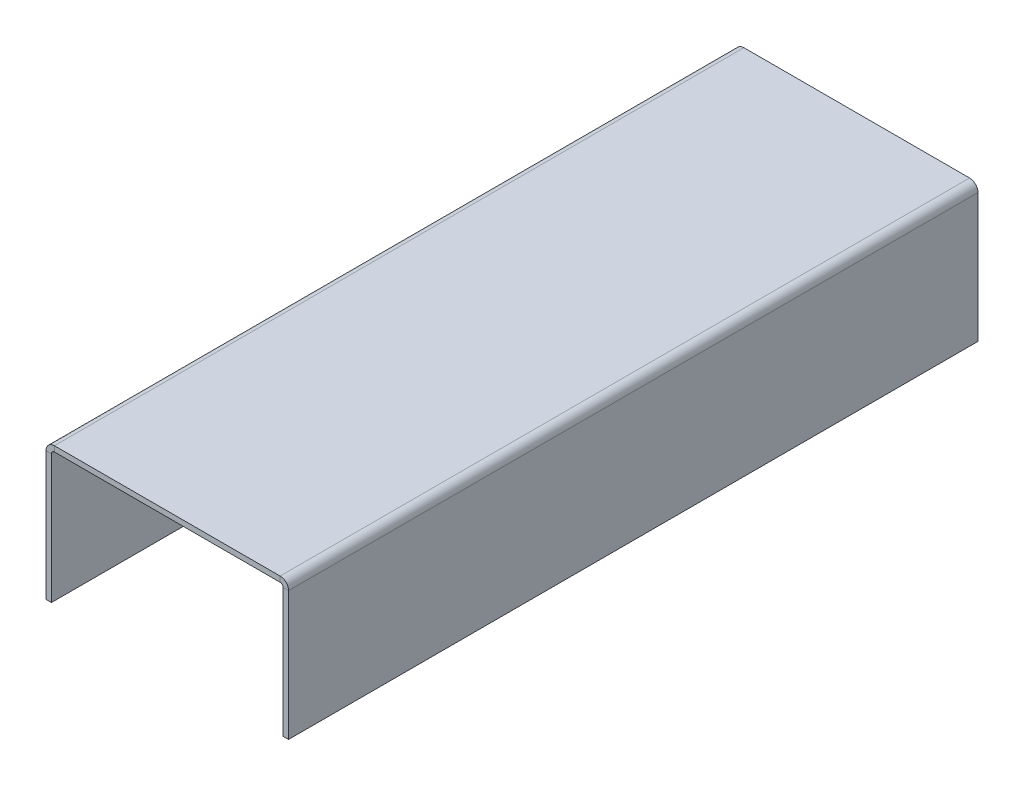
ISO-10303-21;
HEADER;
FILE_DESCRIPTION(('STEP AP214'),'2;1');
FILE_NAME('part.step','',(''),(''),'','','');
FILE_SCHEMA(('AUTOMOTIVE_DESIGN { 1 0 10303 214 1 1 1 1 }'));
ENDSEC;
DATA;
#1=APPLICATION_CONTEXT('core data for automotive mechanical design processes');
#2=APPLICATION_PROTOCOL_DEFINITION('international standard','automotive_design',2000,#1);
#3=PRODUCT_CONTEXT('',#1,'mechanical');
#4=PRODUCT('Part','Part','',(#3));
#5=PRODUCT_RELATED_PRODUCT_CATEGORY('part','',(#4));
#6=PRODUCT_DEFINITION_FORMATION('','',#4);
#7=PRODUCT_DEFINITION_CONTEXT('part definition',#1,'design');
#8=PRODUCT_DEFINITION('design','',#6,#7);
#9=PRODUCT_DEFINITION_SHAPE('','',#8);
#10=(LENGTH_UNIT() NAMED_UNIT(*) SI_UNIT(.MILLI.,.METRE.));
#11=(NAMED_UNIT(*) PLANE_ANGLE_UNIT() SI_UNIT($,.RADIAN.));
#12=(NAMED_UNIT(*) SI_UNIT($,.STERADIAN.) SOLID_ANGLE_UNIT());
#13=UNCERTAINTY_MEASURE_WITH_UNIT(LENGTH_MEASURE(1.E-05),#10,'distance_accuracy_value','');
#14=(GEOMETRIC_REPRESENTATION_CONTEXT(3) GLOBAL_UNCERTAINTY_ASSIGNED_CONTEXT((#13)) GLOBAL_UNIT_ASSIGNED_CONTEXT((#10,
#11,#12)) REPRESENTATION_CONTEXT('',''));
#15=CARTESIAN_POINT('',(0.,0.,0.));
#16=DIRECTION('',(0.,0.,1.));
#17=DIRECTION('',(1.,0.,0.));
#18=AXIS2_PLACEMENT_3D('',#15,#16,#17);
#19=CARTESIAN_POINT('',(1.778,28.9868499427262,145.542));
#20=DIRECTION('',(0.,0.,1.));
#21=DIRECTION('',(1.,0.,0.));
#22=AXIS2_PLACEMENT_3D('',#19,#20,#21);
#23=PLANE('',#22);
#24=DIRECTION('',(0.,-1.,0.));
#25=VECTOR('',#24,1.);
#26=CARTESIAN_POINT('',(1.778,28.9868499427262,145.542));
#27=LINE('',#26,#25);
#28=CARTESIAN_POINT('',(1.778,28.9868499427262,145.542));
#29=VERTEX_POINT('',#28);
#30=CARTESIAN_POINT('',(1.778,27.8438499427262,145.542));
#31=VERTEX_POINT('',#30);
#32=EDGE_CURVE('E11',#29,#31,#27,.T.);
#33=ORIENTED_EDGE('',*,*,#32,.F.);
#34=CARTESIAN_POINT('',(1.778,27.2088499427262,145.542));
#35=DIRECTION('',(0.,0.,1.));
#36=DIRECTION('',(1.,0.,0.));
#37=AXIS2_PLACEMENT_3D('',#34,#35,#36);
#38=CIRCLE('',#37,1.778);
#39=CARTESIAN_POINT('',(0.,27.2088499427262,145.542));
#40=VERTEX_POINT('',#39);
#41=EDGE_CURVE('E249',#40,#29,#38,.F.);
#42=ORIENTED_EDGE('',*,*,#41,.F.);
#43=DIRECTION('',(-1.,0.,0.));
#44=VECTOR('',#43,1.);
#45=CARTESIAN_POINT('',(1.143,27.2088499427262,145.542));
#46=LINE('',#45,#44);
#47=CARTESIAN_POINT('',(1.143,27.2088499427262,145.542));
#48=VERTEX_POINT('',#47);
#49=EDGE_CURVE('E47',#48,#40,#46,.T.);
#50=ORIENTED_EDGE('',*,*,#49,.F.);
#51=CARTESIAN_POINT('',(1.778,27.2088499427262,145.542));
#52=DIRECTION('',(0.,0.,1.));
#53=DIRECTION('',(1.,0.,0.));
#54=AXIS2_PLACEMENT_3D('',#51,#52,#53);
#55=CIRCLE('',#54,0.635);
#56=EDGE_CURVE('E148',#48,#31,#55,.F.);
#57=ORIENTED_EDGE('',*,*,#56,.T.);
#58=EDGE_LOOP('',(#33,#42,#50,#57));
#59=FACE_BOUND('',#58,.T.);
#60=ADVANCED_FACE('F39',(#59),#23,.T.);
#61=CARTESIAN_POINT('',(1.143,27.2088499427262,145.542));
#62=DIRECTION('',(0.,0.,1.));
#63=DIRECTION('',(1.,0.,0.));
#64=AXIS2_PLACEMENT_3D('',#61,#62,#63);
#65=PLANE('',#64);
#66=DIRECTION('',(1.,0.,0.));
#67=VECTOR('',#66,1.);
#68=CARTESIAN_POINT('',(0.,28.9868499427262,145.542));
#69=LINE('',#68,#67);
#70=CARTESIAN_POINT('',(49.4215990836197,28.9868499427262,145.542));
#71=VERTEX_POINT('',#70);
#72=EDGE_CURVE('E142',#29,#71,#69,.T.);
#73=ORIENTED_EDGE('',*,*,#72,.F.);
#74=ORIENTED_EDGE('',*,*,#32,.T.);
#75=DIRECTION('',(1.,0.,0.));
#76=VECTOR('',#75,1.);
#77=CARTESIAN_POINT('',(0.,27.8438499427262,145.542));
#78=LINE('',#77,#76);
#79=CARTESIAN_POINT('',(49.4215990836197,27.8438499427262,145.542));
#80=VERTEX_POINT('',#79);
#81=EDGE_CURVE('E139',#31,#80,#78,.T.);
#82=ORIENTED_EDGE('',*,*,#81,.T.);
#83=DIRECTION('',(0.,1.,0.));
#84=VECTOR('',#83,1.);
#85=CARTESIAN_POINT('',(49.4215990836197,27.8438499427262,145.542));
#86=LINE('',#85,#84);
#87=EDGE_CURVE('E230',#80,#71,#86,.T.);
#88=ORIENTED_EDGE('',*,*,#87,.T.);
#89=EDGE_LOOP('',(#73,#74,#82,#88));
#90=FACE_BOUND('',#89,.T.);
#91=ADVANCED_FACE('F137',(#90),#65,.T.);
#92=CARTESIAN_POINT('',(0.,27.2088499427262,0.));
#93=DIRECTION('',(0.,0.,-1.));
#94=DIRECTION('',(-1.,0.,0.));
#95=AXIS2_PLACEMENT_3D('',#92,#93,#94);
#96=PLANE('',#95);
#97=DIRECTION('',(1.,0.,0.));
#98=VECTOR('',#97,1.);
#99=CARTESIAN_POINT('',(0.,27.2088499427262,0.));
#100=LINE('',#99,#98);
#101=CARTESIAN_POINT('',(0.,27.2088499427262,0.));
#102=VERTEX_POINT('',#101);
#103=CARTESIAN_POINT('',(1.143,27.2088499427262,0.));
#104=VERTEX_POINT('',#103);
#105=EDGE_CURVE('E235',#102,#104,#100,.T.);
#106=ORIENTED_EDGE('',*,*,#105,.F.);
#107=CARTESIAN_POINT('',(1.778,27.2088499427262,0.));
#108=DIRECTION('',(0.,0.,1.));
#109=DIRECTION('',(1.,0.,0.));
#110=AXIS2_PLACEMENT_3D('',#107,#108,#109);
#111=CIRCLE('',#110,1.778);
#112=CARTESIAN_POINT('',(1.778,28.9868499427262,0.));
#113=VERTEX_POINT('',#112);
#114=EDGE_CURVE('E187',#102,#113,#111,.F.);
#115=ORIENTED_EDGE('',*,*,#114,.T.);
#116=DIRECTION('',(0.,1.,0.));
#117=VECTOR('',#116,1.);
#118=CARTESIAN_POINT('',(1.778,27.8438499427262,0.));
#119=LINE('',#118,#117);
#120=CARTESIAN_POINT('',(1.778,27.8438499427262,0.));
#121=VERTEX_POINT('',#120);
#122=EDGE_CURVE('E233',#121,#113,#119,.T.);
#123=ORIENTED_EDGE('',*,*,#122,.F.);
#124=CARTESIAN_POINT('',(1.778,27.2088499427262,0.));
#125=DIRECTION('',(0.,0.,1.));
#126=DIRECTION('',(1.,0.,0.));
#127=AXIS2_PLACEMENT_3D('',#124,#125,#126);
#128=CIRCLE('',#127,0.635);
#129=EDGE_CURVE('E160',#104,#121,#128,.F.);
#130=ORIENTED_EDGE('',*,*,#129,.F.);
#131=EDGE_LOOP('',(#106,#115,#123,#130));
#132=FACE_BOUND('',#131,.T.);
#133=ADVANCED_FACE('F287',(#132),#96,.T.);
#134=CARTESIAN_POINT('',(1.778,27.8438499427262,0.));
#135=DIRECTION('',(0.,0.,-1.));
#136=DIRECTION('',(-1.,0.,0.));
#137=AXIS2_PLACEMENT_3D('',#134,#135,#136);
#138=PLANE('',#137);
#139=DIRECTION('',(0.,1.,0.));
#140=VECTOR('',#139,1.);
#141=CARTESIAN_POINT('',(0.,0.,0.));
#142=LINE('',#141,#140);
#143=CARTESIAN_POINT('',(0.,0.,0.));
#144=VERTEX_POINT('',#143);
#145=EDGE_CURVE('E190',#144,#102,#142,.T.);
#146=ORIENTED_EDGE('',*,*,#145,.T.);
#147=ORIENTED_EDGE('',*,*,#105,.T.);
#148=DIRECTION('',(0.,1.,0.));
#149=VECTOR('',#148,1.);
#150=CARTESIAN_POINT('',(1.143,0.,0.));
#151=LINE('',#150,#149);
#152=CARTESIAN_POINT('',(1.143,0.,0.));
#153=VERTEX_POINT('',#152);
#154=EDGE_CURVE('E196',#153,#104,#151,.T.);
#155=ORIENTED_EDGE('',*,*,#154,.F.);
#156=DIRECTION('',(-1.,0.,0.));
#157=VECTOR('',#156,1.);
#158=CARTESIAN_POINT('',(1.143,0.,0.));
#159=LINE('',#158,#157);
#160=EDGE_CURVE('E193',#153,#144,#159,.T.);
#161=ORIENTED_EDGE('',*,*,#160,.T.);
#162=EDGE_LOOP('',(#146,#147,#155,#161));
#163=FACE_BOUND('',#162,.T.);
#164=ADVANCED_FACE('F290',(#163),#138,.T.);
#165=CARTESIAN_POINT('',(51.1995990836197,27.2088499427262,145.542));
#166=DIRECTION('',(0.,0.,1.));
#167=DIRECTION('',(1.,0.,0.));
#168=AXIS2_PLACEMENT_3D('',#165,#166,#167);
#169=PLANE('',#168);
#170=DIRECTION('',(-1.,0.,0.));
#171=VECTOR('',#170,1.);
#172=CARTESIAN_POINT('',(51.1995990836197,27.2088499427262,145.542));
#173=LINE('',#172,#171);
#174=CARTESIAN_POINT('',(51.1995990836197,27.2088499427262,145.542));
#175=VERTEX_POINT('',#174);
#176=CARTESIAN_POINT('',(50.0565990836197,27.2088499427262,145.542));
#177=VERTEX_POINT('',#176);
#178=EDGE_CURVE('E55',#175,#177,#173,.T.);
#179=ORIENTED_EDGE('',*,*,#178,.F.);
#180=CARTESIAN_POINT('',(49.4215990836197,27.2088499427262,145.542));
#181=DIRECTION('',(0.,0.,1.));
#182=DIRECTION('',(1.,0.,0.));
#183=AXIS2_PLACEMENT_3D('',#180,#181,#182);
#184=CIRCLE('',#183,1.778);
#185=EDGE_CURVE('E259',#71,#175,#184,.F.);
#186=ORIENTED_EDGE('',*,*,#185,.F.);
#187=ORIENTED_EDGE('',*,*,#87,.F.);
#188=CARTESIAN_POINT('',(49.4215990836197,27.2088499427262,145.542));
#189=DIRECTION('',(0.,0.,1.));
#190=DIRECTION('',(1.,0.,0.));
#191=AXIS2_PLACEMENT_3D('',#188,#189,#190);
#192=CIRCLE('',#191,0.635);
#193=EDGE_CURVE('E168',#80,#177,#192,.F.);
#194=ORIENTED_EDGE('',*,*,#193,.T.);
#195=EDGE_LOOP('',(#179,#186,#187,#194));
#196=FACE_BOUND('',#195,.T.);
#197=ADVANCED_FACE('F282',(#196),#169,.T.);
#198=CARTESIAN_POINT('',(49.4215990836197,27.8438499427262,145.542));
#199=DIRECTION('',(0.,0.,1.));
#200=DIRECTION('',(1.,0.,0.));
#201=AXIS2_PLACEMENT_3D('',#198,#199,#200);
#202=PLANE('',#201);
#203=DIRECTION('',(0.,-1.,0.));
#204=VECTOR('',#203,1.);
#205=CARTESIAN_POINT('',(51.1995990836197,28.9868499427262,145.542));
#206=LINE('',#205,#204);
#207=CARTESIAN_POINT('',(51.1995990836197,0.,145.542));
#208=VERTEX_POINT('',#207);
#209=EDGE_CURVE('E262',#175,#208,#206,.T.);
#210=ORIENTED_EDGE('',*,*,#209,.F.);
#211=ORIENTED_EDGE('',*,*,#178,.T.);
#212=DIRECTION('',(0.,1.,0.));
#213=VECTOR('',#212,1.);
#214=CARTESIAN_POINT('',(50.0565990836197,28.9868499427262,145.542));
#215=LINE('',#214,#213);
#216=CARTESIAN_POINT('',(50.0565990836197,0.,145.542));
#217=VERTEX_POINT('',#216);
#218=EDGE_CURVE('E109',#177,#217,#215,.F.);
#219=ORIENTED_EDGE('',*,*,#218,.T.);
#220=DIRECTION('',(-1.,0.,0.));
#221=VECTOR('',#220,1.);
#222=CARTESIAN_POINT('',(51.1995990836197,0.,145.542));
#223=LINE('',#222,#221);
#224=EDGE_CURVE('E265',#208,#217,#223,.T.);
#225=ORIENTED_EDGE('',*,*,#224,.F.);
#226=EDGE_LOOP('',(#210,#211,#219,#225));
#227=FACE_BOUND('',#226,.T.);
#228=ADVANCED_FACE('F271',(#227),#202,.T.);
#229=CARTESIAN_POINT('',(49.4215990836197,28.9868499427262,0.));
#230=DIRECTION('',(0.,0.,-1.));
#231=DIRECTION('',(-1.,0.,0.));
#232=AXIS2_PLACEMENT_3D('',#229,#230,#231);
#233=PLANE('',#232);
#234=DIRECTION('',(0.,-1.,0.));
#235=VECTOR('',#234,1.);
#236=CARTESIAN_POINT('',(49.4215990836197,28.9868499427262,0.));
#237=LINE('',#236,#235);
#238=CARTESIAN_POINT('',(49.4215990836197,28.9868499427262,0.));
#239=VERTEX_POINT('',#238);
#240=CARTESIAN_POINT('',(49.4215990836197,27.8438499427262,0.));
#241=VERTEX_POINT('',#240);
#242=EDGE_CURVE('E96',#239,#241,#237,.T.);
#243=ORIENTED_EDGE('',*,*,#242,.F.);
#244=CARTESIAN_POINT('',(49.4215990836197,27.2088499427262,0.));
#245=DIRECTION('',(0.,0.,1.));
#246=DIRECTION('',(1.,0.,0.));
#247=AXIS2_PLACEMENT_3D('',#244,#245,#246);
#248=CIRCLE('',#247,1.778);
#249=CARTESIAN_POINT('',(51.1995990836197,27.2088499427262,0.));
#250=VERTEX_POINT('',#249);
#251=EDGE_CURVE('E183',#239,#250,#248,.F.);
#252=ORIENTED_EDGE('',*,*,#251,.T.);
#253=DIRECTION('',(1.,0.,0.));
#254=VECTOR('',#253,1.);
#255=CARTESIAN_POINT('',(50.0565990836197,27.2088499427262,0.));
#256=LINE('',#255,#254);
#257=CARTESIAN_POINT('',(50.0565990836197,27.2088499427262,0.));
#258=VERTEX_POINT('',#257);
#259=EDGE_CURVE('E103',#258,#250,#256,.T.);
#260=ORIENTED_EDGE('',*,*,#259,.F.);
#261=CARTESIAN_POINT('',(49.4215990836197,27.2088499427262,0.));
#262=DIRECTION('',(0.,0.,1.));
#263=DIRECTION('',(1.,0.,0.));
#264=AXIS2_PLACEMENT_3D('',#261,#262,#263);
#265=CIRCLE('',#264,0.635);
#266=EDGE_CURVE('E202',#241,#258,#265,.F.);
#267=ORIENTED_EDGE('',*,*,#266,.F.);
#268=EDGE_LOOP('',(#243,#252,#260,#267));
#269=FACE_BOUND('',#268,.T.);
#270=ADVANCED_FACE('F319',(#269),#233,.T.);
#271=CARTESIAN_POINT('',(50.0565990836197,27.2088499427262,0.));
#272=DIRECTION('',(0.,0.,-1.));
#273=DIRECTION('',(-1.,0.,0.));
#274=AXIS2_PLACEMENT_3D('',#271,#272,#273);
#275=PLANE('',#274);
#276=DIRECTION('',(1.,0.,0.));
#277=VECTOR('',#276,1.);
#278=CARTESIAN_POINT('',(0.,28.9868499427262,0.));
#279=LINE('',#278,#277);
#280=EDGE_CURVE('E185',#113,#239,#279,.T.);
#281=ORIENTED_EDGE('',*,*,#280,.T.);
#282=ORIENTED_EDGE('',*,*,#242,.T.);
#283=DIRECTION('',(1.,0.,0.));
#284=VECTOR('',#283,1.);
#285=CARTESIAN_POINT('',(0.,27.8438499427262,0.));
#286=LINE('',#285,#284);
#287=EDGE_CURVE('E200',#121,#241,#286,.T.);
#288=ORIENTED_EDGE('',*,*,#287,.F.);
#289=ORIENTED_EDGE('',*,*,#122,.T.);
#290=EDGE_LOOP('',(#281,#282,#288,#289));
#291=FACE_BOUND('',#290,.T.);
#292=ADVANCED_FACE('F322',(#291),#275,.T.);
#293=CARTESIAN_POINT('',(50.0565990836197,28.9868499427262,145.542));
#294=DIRECTION('',(1.,0.,0.));
#295=DIRECTION('',(0.,0.,-1.));
#296=AXIS2_PLACEMENT_3D('',#293,#294,#295);
#297=PLANE('',#296);
#298=DIRECTION('',(0.,1.,0.));
#299=VECTOR('',#298,1.);
#300=CARTESIAN_POINT('',(50.0565990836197,28.9868499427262,0.));
#301=LINE('',#300,#299);
#302=CARTESIAN_POINT('',(50.0565990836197,0.,0.));
#303=VERTEX_POINT('',#302);
#304=EDGE_CURVE('E174',#258,#303,#301,.F.);
#305=ORIENTED_EDGE('',*,*,#304,.T.);
#306=DIRECTION('',(0.,0.,-1.));
#307=VECTOR('',#306,1.);
#308=CARTESIAN_POINT('',(50.0565990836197,0.,145.542));
#309=LINE('',#308,#307);
#310=EDGE_CURVE('E226',#217,#303,#309,.T.);
#311=ORIENTED_EDGE('',*,*,#310,.F.);
#312=ORIENTED_EDGE('',*,*,#218,.F.);
#313=DIRECTION('',(0.,0.,-1.));
#314=VECTOR('',#313,1.);
#315=CARTESIAN_POINT('',(50.0565990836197,27.2088499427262,145.542));
#316=LINE('',#315,#314);
#317=EDGE_CURVE('E170',#177,#258,#316,.T.);
#318=ORIENTED_EDGE('',*,*,#317,.T.);
#319=EDGE_LOOP('',(#305,#311,#312,#318));
#320=FACE_BOUND('',#319,.T.);
#321=ADVANCED_FACE('F325',(#320),#297,.F.);
#322=CARTESIAN_POINT('',(51.1995990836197,0.,145.542));
#323=DIRECTION('',(0.,-1.,0.));
#324=DIRECTION('',(0.,0.,-1.));
#325=AXIS2_PLACEMENT_3D('',#322,#323,#324);
#326=PLANE('',#325);
#327=DIRECTION('',(-1.,0.,0.));
#328=VECTOR('',#327,1.);
#329=CARTESIAN_POINT('',(51.1995990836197,0.,0.));
#330=LINE('',#329,#328);
#331=CARTESIAN_POINT('',(51.1995990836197,0.,0.));
#332=VERTEX_POINT('',#331);
#333=EDGE_CURVE('E177',#332,#303,#330,.T.);
#334=ORIENTED_EDGE('',*,*,#333,.F.);
#335=DIRECTION('',(0.,0.,-1.));
#336=VECTOR('',#335,1.);
#337=CARTESIAN_POINT('',(51.1995990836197,0.,145.542));
#338=LINE('',#337,#336);
#339=EDGE_CURVE('E224',#208,#332,#338,.T.);
#340=ORIENTED_EDGE('',*,*,#339,.F.);
#341=ORIENTED_EDGE('',*,*,#224,.T.);
#342=ORIENTED_EDGE('',*,*,#310,.T.);
#343=EDGE_LOOP('',(#334,#340,#341,#342));
#344=FACE_BOUND('',#343,.T.);
#345=ADVANCED_FACE('F270',(#344),#326,.T.);
#346=CARTESIAN_POINT('',(51.1995990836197,28.9868499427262,145.542));
#347=DIRECTION('',(1.,0.,0.));
#348=DIRECTION('',(0.,0.,-1.));
#349=AXIS2_PLACEMENT_3D('',#346,#347,#348);
#350=PLANE('',#349);
#351=DIRECTION('',(0.,-1.,0.));
#352=VECTOR('',#351,1.);
#353=CARTESIAN_POINT('',(51.1995990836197,28.9868499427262,0.));
#354=LINE('',#353,#352);
#355=EDGE_CURVE('E180',#250,#332,#354,.T.);
#356=ORIENTED_EDGE('',*,*,#355,.F.);
#357=DIRECTION('',(0.,0.,-1.));
#358=VECTOR('',#357,1.);
#359=CARTESIAN_POINT('',(51.1995990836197,27.2088499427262,145.542));
#360=LINE('',#359,#358);
#361=EDGE_CURVE('E221',#175,#250,#360,.T.);
#362=ORIENTED_EDGE('',*,*,#361,.F.);
#363=ORIENTED_EDGE('',*,*,#209,.T.);
#364=ORIENTED_EDGE('',*,*,#339,.T.);
#365=EDGE_LOOP('',(#356,#362,#363,#364));
#366=FACE_BOUND('',#365,.T.);
#367=ADVANCED_FACE('F275',(#366),#350,.T.);
#368=CARTESIAN_POINT('',(49.4215990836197,27.2088499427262,145.542));
#369=DIRECTION('',(0.,0.,-1.));
#370=DIRECTION('',(-1.,0.,0.));
#371=AXIS2_PLACEMENT_3D('',#368,#369,#370);
#372=CYLINDRICAL_SURFACE('',#371,1.778);
#373=ORIENTED_EDGE('',*,*,#251,.F.);
#374=DIRECTION('',(0.,0.,-1.));
#375=VECTOR('',#374,1.);
#376=CARTESIAN_POINT('',(49.4215990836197,28.9868499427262,145.542));
#377=LINE('',#376,#375);
#378=EDGE_CURVE('E218',#71,#239,#377,.T.);
#379=ORIENTED_EDGE('',*,*,#378,.F.);
#380=ORIENTED_EDGE('',*,*,#185,.T.);
#381=ORIENTED_EDGE('',*,*,#361,.T.);
#382=EDGE_LOOP('',(#373,#379,#380,#381));
#383=FACE_BOUND('',#382,.T.);
#384=ADVANCED_FACE('F278',(#383),#372,.T.);
#385=CARTESIAN_POINT('',(0.,28.9868499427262,145.542));
#386=DIRECTION('',(0.,1.,0.));
#387=DIRECTION('',(0.,0.,1.));
#388=AXIS2_PLACEMENT_3D('',#385,#386,#387);
#389=PLANE('',#388);
#390=ORIENTED_EDGE('',*,*,#280,.F.);
#391=DIRECTION('',(0.,0.,-1.));
#392=VECTOR('',#391,1.);
#393=CARTESIAN_POINT('',(1.778,28.9868499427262,145.542));
#394=LINE('',#393,#392);
#395=EDGE_CURVE('E215',#29,#113,#394,.T.);
#396=ORIENTED_EDGE('',*,*,#395,.F.);
#397=ORIENTED_EDGE('',*,*,#72,.T.);
#398=ORIENTED_EDGE('',*,*,#378,.T.);
#399=EDGE_LOOP('',(#390,#396,#397,#398));
#400=FACE_BOUND('',#399,.T.);
#401=ADVANCED_FACE('F285',(#400),#389,.T.);
#402=CARTESIAN_POINT('',(1.778,27.2088499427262,145.542));
#403=DIRECTION('',(0.,0.,-1.));
#404=DIRECTION('',(-1.,0.,0.));
#405=AXIS2_PLACEMENT_3D('',#402,#403,#404);
#406=CYLINDRICAL_SURFACE('',#405,1.778);
#407=ORIENTED_EDGE('',*,*,#114,.F.);
#408=DIRECTION('',(0.,0.,-1.));
#409=VECTOR('',#408,1.);
#410=CARTESIAN_POINT('',(0.,27.2088499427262,145.542));
#411=LINE('',#410,#409);
#412=EDGE_CURVE('E212',#40,#102,#411,.T.);
#413=ORIENTED_EDGE('',*,*,#412,.F.);
#414=ORIENTED_EDGE('',*,*,#41,.T.);
#415=ORIENTED_EDGE('',*,*,#395,.T.);
#416=EDGE_LOOP('',(#407,#413,#414,#415));
#417=FACE_BOUND('',#416,.T.);
#418=ADVANCED_FACE('F248',(#417),#406,.T.);
#419=CARTESIAN_POINT('',(0.,0.,145.542));
#420=DIRECTION('',(-1.,0.,0.));
#421=DIRECTION('',(0.,0.,1.));
#422=AXIS2_PLACEMENT_3D('',#419,#420,#421);
#423=PLANE('',#422);
#424=ORIENTED_EDGE('',*,*,#145,.F.);
#425=DIRECTION('',(0.,0.,-1.));
#426=VECTOR('',#425,1.);
#427=CARTESIAN_POINT('',(0.,0.,145.542));
#428=LINE('',#427,#426);
#429=CARTESIAN_POINT('',(0.,0.,145.542));
#430=VERTEX_POINT('',#429);
#431=EDGE_CURVE('E210',#430,#144,#428,.T.);
#432=ORIENTED_EDGE('',*,*,#431,.F.);
#433=DIRECTION('',(0.,1.,0.));
#434=VECTOR('',#433,1.);
#435=CARTESIAN_POINT('',(0.,0.,145.542));
#436=LINE('',#435,#434);
#437=EDGE_CURVE('E242',#430,#40,#436,.T.);
#438=ORIENTED_EDGE('',*,*,#437,.T.);
#439=ORIENTED_EDGE('',*,*,#412,.T.);
#440=EDGE_LOOP('',(#424,#432,#438,#439));
#441=FACE_BOUND('',#440,.T.);
#442=ADVANCED_FACE('F253',(#441),#423,.T.);
#443=CARTESIAN_POINT('',(1.143,0.,145.542));
#444=DIRECTION('',(0.,-1.,0.));
#445=DIRECTION('',(0.,0.,-1.));
#446=AXIS2_PLACEMENT_3D('',#443,#444,#445);
#447=PLANE('',#446);
#448=ORIENTED_EDGE('',*,*,#160,.F.);
#449=DIRECTION('',(0.,0.,-1.));
#450=VECTOR('',#449,1.);
#451=CARTESIAN_POINT('',(1.143,0.,145.542));
#452=LINE('',#451,#450);
#453=CARTESIAN_POINT('',(1.143,0.,145.542));
#454=VERTEX_POINT('',#453);
#455=EDGE_CURVE('E208',#454,#153,#452,.T.);
#456=ORIENTED_EDGE('',*,*,#455,.F.);
#457=DIRECTION('',(-1.,0.,0.));
#458=VECTOR('',#457,1.);
#459=CARTESIAN_POINT('',(1.143,0.,145.542));
#460=LINE('',#459,#458);
#461=EDGE_CURVE('E254',#454,#430,#460,.T.);
#462=ORIENTED_EDGE('',*,*,#461,.T.);
#463=ORIENTED_EDGE('',*,*,#431,.T.);
#464=EDGE_LOOP('',(#448,#456,#462,#463));
#465=FACE_BOUND('',#464,.T.);
#466=ADVANCED_FACE('F295',(#465),#447,.T.);
#467=CARTESIAN_POINT('',(1.143,0.,145.542));
#468=DIRECTION('',(-1.,0.,0.));
#469=DIRECTION('',(0.,0.,1.));
#470=AXIS2_PLACEMENT_3D('',#467,#468,#469);
#471=PLANE('',#470);
#472=ORIENTED_EDGE('',*,*,#154,.T.);
#473=DIRECTION('',(0.,0.,-1.));
#474=VECTOR('',#473,1.);
#475=CARTESIAN_POINT('',(1.143,27.2088499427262,145.542));
#476=LINE('',#475,#474);
#477=EDGE_CURVE('E162',#48,#104,#476,.T.);
#478=ORIENTED_EDGE('',*,*,#477,.F.);
#479=DIRECTION('',(0.,1.,0.));
#480=VECTOR('',#479,1.);
#481=CARTESIAN_POINT('',(1.143,0.,145.542));
#482=LINE('',#481,#480);
#483=EDGE_CURVE('E153',#454,#48,#482,.T.);
#484=ORIENTED_EDGE('',*,*,#483,.F.);
#485=ORIENTED_EDGE('',*,*,#455,.T.);
#486=EDGE_LOOP('',(#472,#478,#484,#485));
#487=FACE_BOUND('',#486,.T.);
#488=ADVANCED_FACE('F293',(#487),#471,.F.);
#489=CARTESIAN_POINT('',(1.778,27.2088499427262,145.542));
#490=DIRECTION('',(0.,0.,-1.));
#491=DIRECTION('',(-1.,0.,0.));
#492=AXIS2_PLACEMENT_3D('',#489,#490,#491);
#493=CYLINDRICAL_SURFACE('',#492,0.635);
#494=ORIENTED_EDGE('',*,*,#129,.T.);
#495=DIRECTION('',(0.,0.,-1.));
#496=VECTOR('',#495,1.);
#497=CARTESIAN_POINT('',(1.778,27.8438499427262,145.542));
#498=LINE('',#497,#496);
#499=EDGE_CURVE('E157',#31,#121,#498,.T.);
#500=ORIENTED_EDGE('',*,*,#499,.F.);
#501=ORIENTED_EDGE('',*,*,#56,.F.);
#502=ORIENTED_EDGE('',*,*,#477,.T.);
#503=EDGE_LOOP('',(#494,#500,#501,#502));
#504=FACE_BOUND('',#503,.T.);
#505=ADVANCED_FACE('F158',(#504),#493,.F.);
#506=CARTESIAN_POINT('',(0.,27.8438499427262,145.542));
#507=DIRECTION('',(0.,1.,0.));
#508=DIRECTION('',(0.,0.,1.));
#509=AXIS2_PLACEMENT_3D('',#506,#507,#508);
#510=PLANE('',#509);
#511=ORIENTED_EDGE('',*,*,#287,.T.);
#512=DIRECTION('',(0.,0.,-1.));
#513=VECTOR('',#512,1.);
#514=CARTESIAN_POINT('',(49.4215990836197,27.8438499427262,145.542));
#515=LINE('',#514,#513);
#516=EDGE_CURVE('E163',#80,#241,#515,.T.);
#517=ORIENTED_EDGE('',*,*,#516,.F.);
#518=ORIENTED_EDGE('',*,*,#81,.F.);
#519=ORIENTED_EDGE('',*,*,#499,.T.);
#520=EDGE_LOOP('',(#511,#517,#518,#519));
#521=FACE_BOUND('',#520,.T.);
#522=ADVANCED_FACE('F165',(#521),#510,.F.);
#523=CARTESIAN_POINT('',(49.4215990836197,27.2088499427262,145.542));
#524=DIRECTION('',(0.,0.,-1.));
#525=DIRECTION('',(-1.,0.,0.));
#526=AXIS2_PLACEMENT_3D('',#523,#524,#525);
#527=CYLINDRICAL_SURFACE('',#526,0.635);
#528=ORIENTED_EDGE('',*,*,#266,.T.);
#529=ORIENTED_EDGE('',*,*,#317,.F.);
#530=ORIENTED_EDGE('',*,*,#193,.F.);
#531=ORIENTED_EDGE('',*,*,#516,.T.);
#532=EDGE_LOOP('',(#528,#529,#530,#531));
#533=FACE_BOUND('',#532,.T.);
#534=ADVANCED_FACE('F363',(#533),#527,.F.);
#535=CARTESIAN_POINT('',(49.4215990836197,27.2088499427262,145.542));
#536=DIRECTION('',(0.,0.,1.));
#537=DIRECTION('',(1.,0.,0.));
#538=AXIS2_PLACEMENT_3D('',#535,#536,#537);
#539=PLANE('',#538);
#540=ORIENTED_EDGE('',*,*,#483,.T.);
#541=ORIENTED_EDGE('',*,*,#49,.T.);
#542=ORIENTED_EDGE('',*,*,#437,.F.);
#543=ORIENTED_EDGE('',*,*,#461,.F.);
#544=EDGE_LOOP('',(#540,#541,#542,#543));
#545=FACE_BOUND('',#544,.T.);
#546=ADVANCED_FACE('F239',(#545),#539,.T.);
#547=CARTESIAN_POINT('',(49.4215990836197,27.2088499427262,0.));
#548=DIRECTION('',(0.,0.,1.));
#549=DIRECTION('',(1.,0.,0.));
#550=AXIS2_PLACEMENT_3D('',#547,#548,#549);
#551=PLANE('',#550);
#552=ORIENTED_EDGE('',*,*,#304,.F.);
#553=ORIENTED_EDGE('',*,*,#259,.T.);
#554=ORIENTED_EDGE('',*,*,#355,.T.);
#555=ORIENTED_EDGE('',*,*,#333,.T.);
#556=EDGE_LOOP('',(#552,#553,#554,#555));
#557=FACE_BOUND('',#556,.T.);
#558=ADVANCED_FACE('F376',(#557),#551,.F.);
#559=CLOSED_SHELL('',(#60,#91,#133,#164,#197,#228,#270,#292,#321,#345,#367,#384,#401,#418,#442,
#466,#488,#505,#522,#534,#546,#558));
#560=MANIFOLD_SOLID_BREP('B2',#559);
#561=ADVANCED_BREP_SHAPE_REPRESENTATION('',(#18,#560),#14);
#562=SHAPE_DEFINITION_REPRESENTATION(#9,#561);
ENDSEC;
END-ISO-10303-21;
